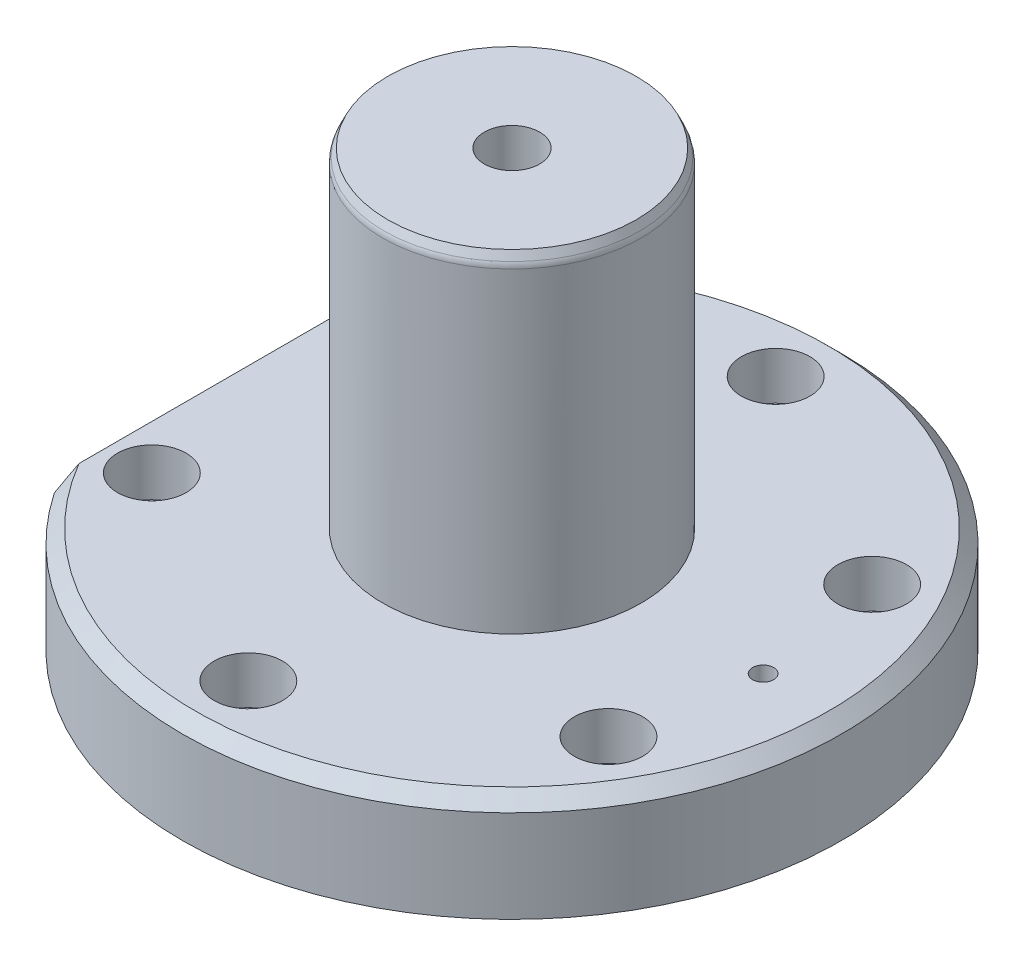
from build123d import *

# Parameters (mm, degrees)
CHANFREIN1_SIZE                                    = 4
CHANFREIN1_SIZE2                                   = 1.865230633
CHANFREIN2_SIZE                                    = 5
CHANFREIN3_SIZE                                    = 3
CHANFREIN3_SIZE2                                   = 1.732050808
TROU_TARAUD_M241_D                                 = 21
TROU_TARAUD_M241_DEPTH                             = 63
TROU_TARAUD_M241_TIP                               = 6.3090365
ENL_V_MAT_EXTRU_1_REACH                            = 280.343
ESQUISSE5_W                                        = 21.5
ESQUISSE5_H                                        = 40
ENL_V_MAT_EXTRU_1_DIRECTION_2_REACH                = 280.343
DIAM_TRE_DU_PER_AGE_8_0_8_1_D                      = 8
CHAMBRAGE_POUR_VIS_T_TE_HEXAGONALE_M16_D           = 17.5
CHAMBRAGE_POUR_VIS_T_TE_HEXAGONALE_M16_CBORE_D     = 26
CHAMBRAGE_POUR_VIS_T_TE_HEXAGONALE_M16_CBORE_DEPTH = 18
CONG_1_R                                           = 5


with BuildPart() as part:
    # Esquisse1 → R_volution1 (revolve)
    with BuildSketch(Plane.XY, mode=Mode.PRIVATE) as r_volution1_sk:
        Polygon((15, 50), (125, 50), (125, 90), (49, 90), (49, 215), (0, 215), (0, 40), (15, 40), align=None)
    revolve(r_volution1_sk.sketch.rotate(Axis((0, 0, 0), (0, 1, 0)), 90), axis=Axis((0, 0, 0), (0, 1, 0)))

    # Chanfrein1
    chanfrein1_edges = [part.edges().sort_by_distance(p)[0] for p in [
        (0, 215, 49),
    ]]
    chanfrein1_side = [part.faces().sort_by_distance(p)[0] for p in [
        (0, 152.5, 49),
    ]]
    chamfer(chanfrein1_edges, length=CHANFREIN1_SIZE, length2=CHANFREIN1_SIZE2, reference=chanfrein1_side[0])

    # Chanfrein2
    chanfrein2_edges = [part.edges().sort_by_distance(p)[0] for p in [
        (0, 90, 125),
    ]]
    chamfer(chanfrein2_edges, length=CHANFREIN2_SIZE)

    # Chanfrein3
    chanfrein3_edges = [part.edges().sort_by_distance(p)[0] for p in [
        (0, 40, 15),
    ]]
    chanfrein3_side = [part.faces().sort_by_distance(p)[0] for p in [
        (0, 45, 15),
    ]]
    chamfer(chanfrein3_edges, length=CHANFREIN3_SIZE, length2=CHANFREIN3_SIZE2, reference=chanfrein3_side[0])

    # Trou taraud_ M241
    with Locations(Plane(origin=(0, 215, 0), x_dir=(-1, 0, 0), z_dir=(0, 1, 0))):
        with Locations((0, 0)):
            Hole(TROU_TARAUD_M241_D / 2, depth=TROU_TARAUD_M241_DEPTH)
            with Locations((0, 0, -(TROU_TARAUD_M241_DEPTH + TROU_TARAUD_M241_TIP / 2))):  # 118° drill point
                Cone(0, TROU_TARAUD_M241_D / 2, TROU_TARAUD_M241_TIP, mode=Mode.SUBTRACT)

    # Esquisse5 → Enl_v. mat.-Extru.1 (cut, up to next)
    with BuildSketch(Plane.XY, mode=Mode.PRIVATE) as enl_v_mat_extru_1_sk1:
        with Locations((-114.25, 70)):
            Rectangle(ESQUISSE5_W, ESQUISSE5_H)
    enl_v_mat_extru_1_tool1 = extrude(enl_v_mat_extru_1_sk1.sketch, amount=-ENL_V_MAT_EXTRU_1_REACH, mode=Mode.PRIVATE) & part.part
    add(enl_v_mat_extru_1_tool1.solids().sort_by_distance((-114.25, 70, 0))[0], mode=Mode.SUBTRACT)

    # Esquisse5 → Enl_v. mat.-Extru.1 direction 2 (cut, up to next)
    with BuildSketch(Plane.XY, mode=Mode.PRIVATE) as enl_v_mat_extru_1_direction_2_sk1:
        with Locations((-114.25, 70)):
            Rectangle(ESQUISSE5_W, ESQUISSE5_H)
    enl_v_mat_extru_1_direction_2_tool1 = extrude(enl_v_mat_extru_1_direction_2_sk1.sketch, amount=ENL_V_MAT_EXTRU_1_DIRECTION_2_REACH, mode=Mode.PRIVATE) & part.part
    add(enl_v_mat_extru_1_direction_2_tool1.solids().sort_by_distance((-114.25, 70, 0))[0], mode=Mode.SUBTRACT)

    # Diam_tre du per_age _8.0 _8_1 (through all)
    with Locations(Plane(origin=(0, 90, 0), x_dir=(-1, 0, 0), z_dir=(0, 1, 0))):
        with Locations((-95.25, 0)):
            Hole(DIAM_TRE_DU_PER_AGE_8_0_8_1_D / 2)

    # Chambrage pour vis _ t_te hexagonale M16 (through all)
    with Locations(Plane(origin=(0, 90, 0), x_dir=(0, 0, -1), z_dir=(0, 1, 0))):
        with Locations((-50, -86.602540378), (-50, 86.602540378), (50, 86.602540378), (50, -86.602540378), (100, 0), (-100, 0)):
            CounterBoreHole(CHAMBRAGE_POUR_VIS_T_TE_HEXAGONALE_M16_D / 2, CHAMBRAGE_POUR_VIS_T_TE_HEXAGONALE_M16_CBORE_D / 2, CHAMBRAGE_POUR_VIS_T_TE_HEXAGONALE_M16_CBORE_DEPTH)

    # Cong_1
    cong_1_edges = [part.edges().sort_by_distance(p)[0] for p in [
        (0, 211, 49),
    ]]
    fillet(cong_1_edges, radius=CONG_1_R)


solid = part.part
